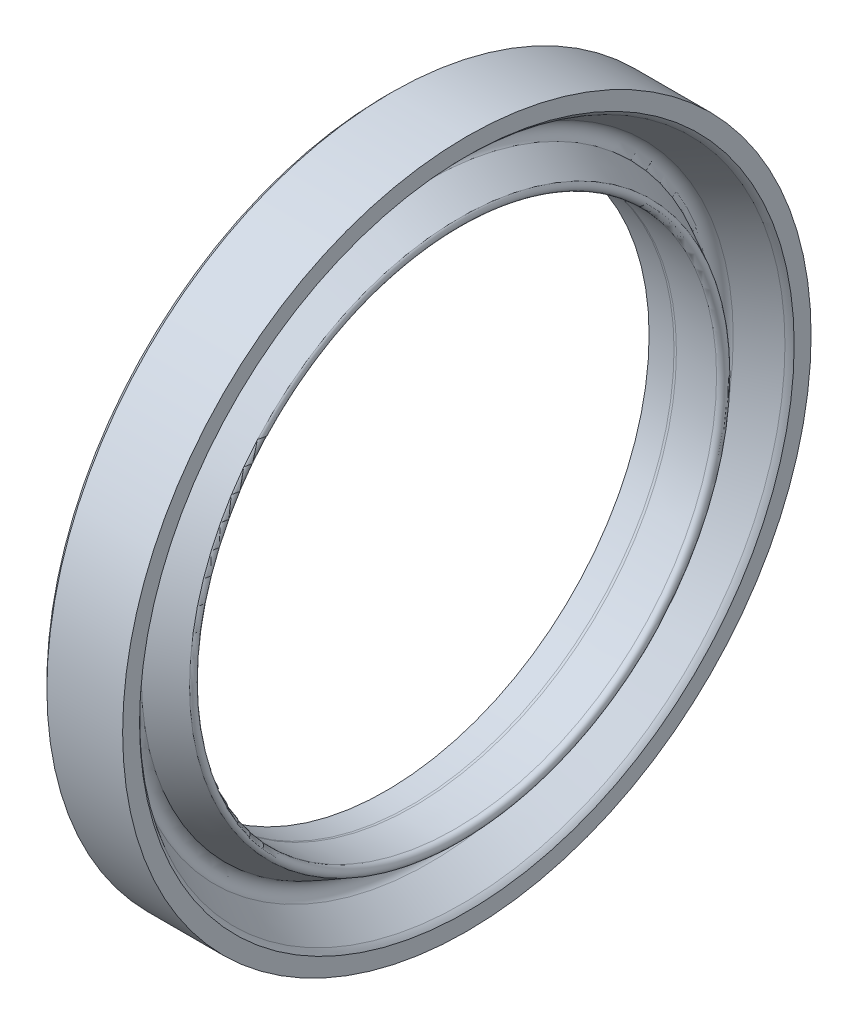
from build123d import *


with BuildPart() as part:
    # Esquisse2 → R_volution2 (revolve)
    with BuildSketch(Plane.XY, mode=Mode.PRIVATE) as r_volution2_sk:
        with BuildLine():
            Line((-9.1, -42.5), (-9.75, -41.85))
            Line((-9.75, -41.85), (-9.75, -32.5))
            Line((-9.75, -32.5), (-6.671148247, -32.5))
            ThreePointArc((-6.671148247, -32.5), (-6.501464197, -32.48887832), (-6.334683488, -32.455703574))
            Line((-6.334683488, -32.455703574), (-1.196815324, -32.278716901))
            ThreePointArc((-1.196815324, -32.278716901), (-0.484142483, -32.592300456), (-0.636042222, -33.355952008))
            Line((-0.636042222, -33.355952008), (-4.559729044, -35.389681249))
            ThreePointArc((-4.559729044, -35.389681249), (-5.019158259, -36.498841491), (-4.374105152, -37.51137205))
            Line((-4.374105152, -37.51137205), (-0.325, -39.849124))
            ThreePointArc((-0.325, -39.849124), (-0.017145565, -40.109790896), (0.25, -40.412040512))
            Line((0.25, -40.412040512), (0.25, -42.5))
            Line((0.25, -42.5), (-9.1, -42.5))
        make_face()
    revolve(r_volution2_sk.sketch.rotate(Axis((2.43404063, 0, 0), (-1, 0, 0)), 270), axis=Axis((2.43404063, 0, 0), (-1, 0, 0)))


solid = part.part
